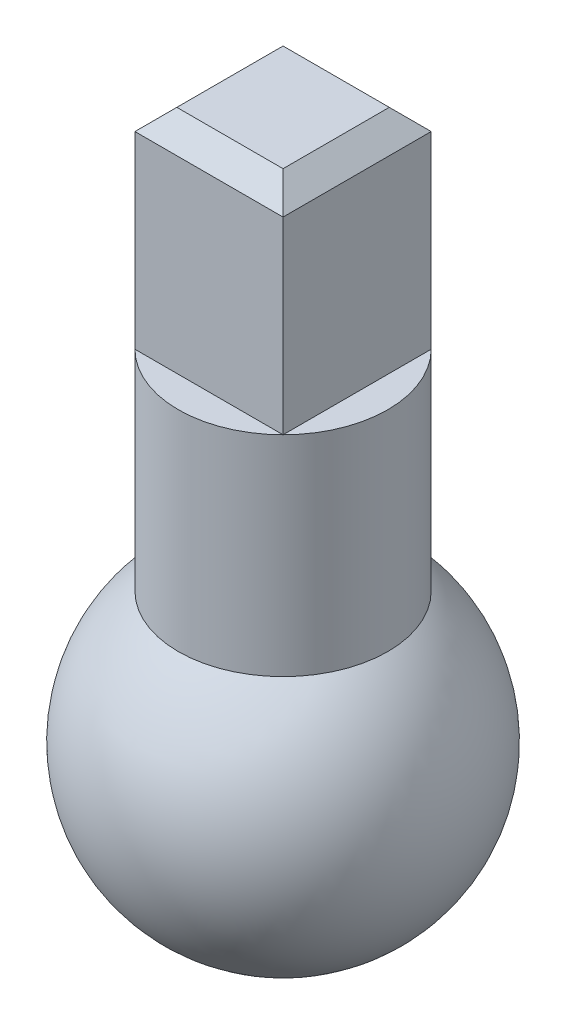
ISO-10303-21;
HEADER;
FILE_DESCRIPTION(('STEP AP214'),'2;1');
FILE_NAME('part.step','',(''),(''),'','','');
FILE_SCHEMA(('AUTOMOTIVE_DESIGN { 1 0 10303 214 1 1 1 1 }'));
ENDSEC;
DATA;
#1=APPLICATION_CONTEXT('core data for automotive mechanical design processes');
#2=APPLICATION_PROTOCOL_DEFINITION('international standard','automotive_design',2000,#1);
#3=PRODUCT_CONTEXT('',#1,'mechanical');
#4=PRODUCT('Part','Part','',(#3));
#5=PRODUCT_RELATED_PRODUCT_CATEGORY('part','',(#4));
#6=PRODUCT_DEFINITION_FORMATION('','',#4);
#7=PRODUCT_DEFINITION_CONTEXT('part definition',#1,'design');
#8=PRODUCT_DEFINITION('design','',#6,#7);
#9=PRODUCT_DEFINITION_SHAPE('','',#8);
#10=(LENGTH_UNIT() NAMED_UNIT(*) SI_UNIT(.MILLI.,.METRE.));
#11=(NAMED_UNIT(*) PLANE_ANGLE_UNIT() SI_UNIT($,.RADIAN.));
#12=(NAMED_UNIT(*) SI_UNIT($,.STERADIAN.) SOLID_ANGLE_UNIT());
#13=UNCERTAINTY_MEASURE_WITH_UNIT(LENGTH_MEASURE(1.E-05),#10,'distance_accuracy_value','');
#14=(GEOMETRIC_REPRESENTATION_CONTEXT(3) GLOBAL_UNCERTAINTY_ASSIGNED_CONTEXT((#13)) GLOBAL_UNIT_ASSIGNED_CONTEXT((#10,
#11,#12)) REPRESENTATION_CONTEXT('',''));
#15=CARTESIAN_POINT('',(0.,0.,0.));
#16=DIRECTION('',(0.,0.,1.));
#17=DIRECTION('',(1.,0.,0.));
#18=AXIS2_PLACEMENT_3D('',#15,#16,#17);
#19=CARTESIAN_POINT('',(0.,5.,0.));
#20=DIRECTION('',(0.,1.,0.));
#21=DIRECTION('',(0.,0.,1.));
#22=AXIS2_PLACEMENT_3D('',#19,#20,#21);
#23=PLANE('',#22);
#24=DIRECTION('',(0.,0.,-1.));
#25=VECTOR('',#24,1.);
#26=CARTESIAN_POINT('',(1.76776695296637,5.,-1.76776695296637));
#27=LINE('',#26,#25);
#28=CARTESIAN_POINT('',(1.76776695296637,5.,1.76776695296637));
#29=VERTEX_POINT('',#28);
#30=CARTESIAN_POINT('',(1.76776695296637,5.,-1.76776695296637));
#31=VERTEX_POINT('',#30);
#32=EDGE_CURVE('E117',#29,#31,#27,.T.);
#33=ORIENTED_EDGE('',*,*,#32,.F.);
#34=CARTESIAN_POINT('',(0.,5.,0.));
#35=DIRECTION('',(0.,1.,0.));
#36=DIRECTION('',(0.,0.,1.));
#37=AXIS2_PLACEMENT_3D('',#34,#35,#36);
#38=CIRCLE('',#37,2.5);
#39=EDGE_CURVE('E103',#29,#31,#38,.T.);
#40=ORIENTED_EDGE('',*,*,#39,.T.);
#41=EDGE_LOOP('',(#33,#40));
#42=FACE_BOUND('',#41,.T.);
#43=ADVANCED_FACE('F32',(#42),#23,.T.);
#44=DIRECTION('',(1.,0.,0.));
#45=VECTOR('',#44,1.);
#46=CARTESIAN_POINT('',(-1.76776695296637,5.,1.76776695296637));
#47=LINE('',#46,#45);
#48=CARTESIAN_POINT('',(-1.76776695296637,5.,1.76776695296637));
#49=VERTEX_POINT('',#48);
#50=EDGE_CURVE('E114',#49,#29,#47,.T.);
#51=ORIENTED_EDGE('',*,*,#50,.F.);
#52=EDGE_CURVE('E111',#49,#29,#38,.T.);
#53=ORIENTED_EDGE('',*,*,#52,.T.);
#54=EDGE_LOOP('',(#51,#53));
#55=FACE_BOUND('',#54,.T.);
#56=ADVANCED_FACE('F185',(#55),#23,.T.);
#57=DIRECTION('',(0.,0.,1.));
#58=VECTOR('',#57,1.);
#59=CARTESIAN_POINT('',(-1.76776695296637,5.,-1.76776695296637));
#60=LINE('',#59,#58);
#61=CARTESIAN_POINT('',(-1.76776695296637,5.,-1.76776695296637));
#62=VERTEX_POINT('',#61);
#63=EDGE_CURVE('E88',#62,#49,#60,.T.);
#64=ORIENTED_EDGE('',*,*,#63,.F.);
#65=EDGE_CURVE('E104',#62,#49,#38,.T.);
#66=ORIENTED_EDGE('',*,*,#65,.T.);
#67=EDGE_LOOP('',(#64,#66));
#68=FACE_BOUND('',#67,.T.);
#69=ADVANCED_FACE('F113',(#68),#23,.T.);
#70=CARTESIAN_POINT('',(0.,5.,0.));
#71=DIRECTION('',(0.,-1.,0.));
#72=DIRECTION('',(0.,0.,-1.));
#73=AXIS2_PLACEMENT_3D('',#70,#71,#72);
#74=CYLINDRICAL_SURFACE('',#73,2.5);
#75=ORIENTED_EDGE('',*,*,#39,.F.);
#76=ORIENTED_EDGE('',*,*,#52,.F.);
#77=ORIENTED_EDGE('',*,*,#65,.F.);
#78=EDGE_CURVE('E96',#31,#62,#38,.T.);
#79=ORIENTED_EDGE('',*,*,#78,.F.);
#80=EDGE_LOOP('',(#75,#76,#77,#79));
#81=FACE_BOUND('',#80,.T.);
#82=CARTESIAN_POINT('',(0.,0.,0.));
#83=DIRECTION('',(0.,1.,0.));
#84=DIRECTION('',(0.,0.,1.));
#85=AXIS2_PLACEMENT_3D('',#82,#83,#84);
#86=CIRCLE('',#85,2.5);
#87=CARTESIAN_POINT('',(0.,0.,2.5));
#88=VERTEX_POINT('',#87);
#89=EDGE_CURVE('E36',#88,#88,#86,.T.);
#90=ORIENTED_EDGE('',*,*,#89,.T.);
#91=EDGE_LOOP('',(#90));
#92=FACE_BOUND('',#91,.T.);
#93=ADVANCED_FACE('F108',(#81,#92),#74,.T.);
#94=DIRECTION('',(-1.,0.,0.));
#95=VECTOR('',#94,1.);
#96=CARTESIAN_POINT('',(-1.76776695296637,5.,-1.76776695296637));
#97=LINE('',#96,#95);
#98=EDGE_CURVE('E99',#31,#62,#97,.T.);
#99=ORIENTED_EDGE('',*,*,#98,.F.);
#100=ORIENTED_EDGE('',*,*,#78,.T.);
#101=EDGE_LOOP('',(#99,#100));
#102=FACE_BOUND('',#101,.T.);
#103=ADVANCED_FACE('F98',(#102),#23,.T.);
#104=CARTESIAN_POINT('',(0.,-3.10985915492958,0.));
#105=DIRECTION('',(0.,0.,1.));
#106=DIRECTION('',(1.,0.,0.));
#107=AXIS2_PLACEMENT_3D('',#104,#105,#106);
#108=SPHERICAL_SURFACE('',#107,3.99014084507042);
#109=CARTESIAN_POINT('',(0.,-3.10985915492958,0.));
#110=DIRECTION('',(0.,1.,0.));
#111=DIRECTION('',(0.,0.,1.));
#112=AXIS2_PLACEMENT_3D('',#109,#110,#111);
#113=SPHERICAL_SURFACE('',#112,3.99014084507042);
#114=ORIENTED_EDGE('',*,*,#89,.F.);
#115=EDGE_LOOP('',(#114));
#116=FACE_BOUND('',#115,.T.);
#117=ADVANCED_FACE('F34',(#116),#113,.T.);
#118=CARTESIAN_POINT('',(1.76776695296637,10.,-1.76776695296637));
#119=DIRECTION('',(-1.,0.,0.));
#120=DIRECTION('',(0.,0.,1.));
#121=AXIS2_PLACEMENT_3D('',#118,#119,#120);
#122=PLANE('',#121);
#123=DIRECTION('',(0.,-1.,0.));
#124=VECTOR('',#123,1.);
#125=CARTESIAN_POINT('',(1.76776695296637,10.,-1.76776695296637));
#126=LINE('',#125,#124);
#127=CARTESIAN_POINT('',(1.76776695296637,9.5,-1.76776695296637));
#128=VERTEX_POINT('',#127);
#129=EDGE_CURVE('E90',#128,#31,#126,.T.);
#130=ORIENTED_EDGE('',*,*,#129,.F.);
#131=DIRECTION('',(0.,0.,1.));
#132=VECTOR('',#131,1.);
#133=CARTESIAN_POINT('',(1.76776695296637,9.5,1.76776695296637));
#134=LINE('',#133,#132);
#135=CARTESIAN_POINT('',(1.76776695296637,9.5,1.76776695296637));
#136=VERTEX_POINT('',#135);
#137=EDGE_CURVE('E11',#128,#136,#134,.T.);
#138=ORIENTED_EDGE('',*,*,#137,.T.);
#139=DIRECTION('',(0.,-1.,0.));
#140=VECTOR('',#139,1.);
#141=CARTESIAN_POINT('',(1.76776695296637,10.,1.76776695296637));
#142=LINE('',#141,#140);
#143=EDGE_CURVE('E125',#136,#29,#142,.T.);
#144=ORIENTED_EDGE('',*,*,#143,.T.);
#145=ORIENTED_EDGE('',*,*,#32,.T.);
#146=EDGE_LOOP('',(#130,#138,#144,#145));
#147=FACE_BOUND('',#146,.T.);
#148=ADVANCED_FACE('F166',(#147),#122,.F.);
#149=CARTESIAN_POINT('',(-1.76776695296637,10.,-1.76776695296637));
#150=DIRECTION('',(0.,0.,1.));
#151=DIRECTION('',(1.,0.,0.));
#152=AXIS2_PLACEMENT_3D('',#149,#150,#151);
#153=PLANE('',#152);
#154=DIRECTION('',(0.,-1.,0.));
#155=VECTOR('',#154,1.);
#156=CARTESIAN_POINT('',(-1.76776695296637,10.,-1.76776695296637));
#157=LINE('',#156,#155);
#158=CARTESIAN_POINT('',(-1.76776695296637,9.5,-1.76776695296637));
#159=VERTEX_POINT('',#158);
#160=EDGE_CURVE('E84',#159,#62,#157,.T.);
#161=ORIENTED_EDGE('',*,*,#160,.F.);
#162=DIRECTION('',(1.,0.,0.));
#163=VECTOR('',#162,1.);
#164=CARTESIAN_POINT('',(1.76776695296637,9.5,-1.76776695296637));
#165=LINE('',#164,#163);
#166=EDGE_CURVE('E41',#159,#128,#165,.T.);
#167=ORIENTED_EDGE('',*,*,#166,.T.);
#168=ORIENTED_EDGE('',*,*,#129,.T.);
#169=ORIENTED_EDGE('',*,*,#98,.T.);
#170=EDGE_LOOP('',(#161,#167,#168,#169));
#171=FACE_BOUND('',#170,.T.);
#172=ADVANCED_FACE('F116',(#171),#153,.F.);
#173=CARTESIAN_POINT('',(-1.76776695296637,10.,-1.76776695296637));
#174=DIRECTION('',(1.,0.,0.));
#175=DIRECTION('',(0.,0.,-1.));
#176=AXIS2_PLACEMENT_3D('',#173,#174,#175);
#177=PLANE('',#176);
#178=DIRECTION('',(0.,-1.,0.));
#179=VECTOR('',#178,1.);
#180=CARTESIAN_POINT('',(-1.76776695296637,10.,1.76776695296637));
#181=LINE('',#180,#179);
#182=CARTESIAN_POINT('',(-1.76776695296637,9.5,1.76776695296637));
#183=VERTEX_POINT('',#182);
#184=EDGE_CURVE('E91',#183,#49,#181,.T.);
#185=ORIENTED_EDGE('',*,*,#184,.F.);
#186=DIRECTION('',(0.,0.,-1.));
#187=VECTOR('',#186,1.);
#188=CARTESIAN_POINT('',(-1.76776695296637,9.5,-1.76776695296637));
#189=LINE('',#188,#187);
#190=EDGE_CURVE('E56',#183,#159,#189,.T.);
#191=ORIENTED_EDGE('',*,*,#190,.T.);
#192=ORIENTED_EDGE('',*,*,#160,.T.);
#193=ORIENTED_EDGE('',*,*,#63,.T.);
#194=EDGE_LOOP('',(#185,#191,#192,#193));
#195=FACE_BOUND('',#194,.T.);
#196=ADVANCED_FACE('F86',(#195),#177,.F.);
#197=CARTESIAN_POINT('',(-1.76776695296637,10.,1.76776695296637));
#198=DIRECTION('',(0.,0.,-1.));
#199=DIRECTION('',(-1.,0.,0.));
#200=AXIS2_PLACEMENT_3D('',#197,#198,#199);
#201=PLANE('',#200);
#202=ORIENTED_EDGE('',*,*,#143,.F.);
#203=DIRECTION('',(-1.,0.,0.));
#204=VECTOR('',#203,1.);
#205=CARTESIAN_POINT('',(-1.76776695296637,9.5,1.76776695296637));
#206=LINE('',#205,#204);
#207=EDGE_CURVE('E138',#136,#183,#206,.T.);
#208=ORIENTED_EDGE('',*,*,#207,.T.);
#209=ORIENTED_EDGE('',*,*,#184,.T.);
#210=ORIENTED_EDGE('',*,*,#50,.T.);
#211=EDGE_LOOP('',(#202,#208,#209,#210));
#212=FACE_BOUND('',#211,.T.);
#213=ADVANCED_FACE('F170',(#212),#201,.F.);
#214=CARTESIAN_POINT('',(0.,10.,0.));
#215=DIRECTION('',(0.,1.,0.));
#216=DIRECTION('',(0.,0.,1.));
#217=AXIS2_PLACEMENT_3D('',#214,#215,#216);
#218=PLANE('',#217);
#219=DIRECTION('',(0.,0.,1.));
#220=VECTOR('',#219,1.);
#221=CARTESIAN_POINT('',(-1.26776695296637,10.,1.76776695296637));
#222=LINE('',#221,#220);
#223=CARTESIAN_POINT('',(-1.26776695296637,10.,-1.26776695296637));
#224=VERTEX_POINT('',#223);
#225=CARTESIAN_POINT('',(-1.26776695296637,10.,1.26776695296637));
#226=VERTEX_POINT('',#225);
#227=EDGE_CURVE('E133',#224,#226,#222,.T.);
#228=ORIENTED_EDGE('',*,*,#227,.T.);
#229=DIRECTION('',(1.,0.,0.));
#230=VECTOR('',#229,1.);
#231=CARTESIAN_POINT('',(1.76776695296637,10.,1.26776695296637));
#232=LINE('',#231,#230);
#233=CARTESIAN_POINT('',(1.26776695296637,10.,1.26776695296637));
#234=VERTEX_POINT('',#233);
#235=EDGE_CURVE('E135',#226,#234,#232,.T.);
#236=ORIENTED_EDGE('',*,*,#235,.T.);
#237=DIRECTION('',(0.,0.,-1.));
#238=VECTOR('',#237,1.);
#239=CARTESIAN_POINT('',(1.26776695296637,10.,-1.76776695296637));
#240=LINE('',#239,#238);
#241=CARTESIAN_POINT('',(1.26776695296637,10.,-1.26776695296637));
#242=VERTEX_POINT('',#241);
#243=EDGE_CURVE('E129',#234,#242,#240,.T.);
#244=ORIENTED_EDGE('',*,*,#243,.T.);
#245=DIRECTION('',(-1.,0.,0.));
#246=VECTOR('',#245,1.);
#247=CARTESIAN_POINT('',(-1.76776695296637,10.,-1.26776695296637));
#248=LINE('',#247,#246);
#249=EDGE_CURVE('E131',#242,#224,#248,.T.);
#250=ORIENTED_EDGE('',*,*,#249,.T.);
#251=EDGE_LOOP('',(#228,#236,#244,#250));
#252=FACE_BOUND('',#251,.T.);
#253=ADVANCED_FACE('F176',(#252),#218,.T.);
#254=CARTESIAN_POINT('',(0.,10.,-1.26776695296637));
#255=DIRECTION('',(0.,0.707106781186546,-0.707106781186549));
#256=DIRECTION('',(1.,0.,0.));
#257=AXIS2_PLACEMENT_3D('',#254,#255,#256);
#258=PLANE('',#257);
#259=DIRECTION('',(-0.577350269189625,0.577350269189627,0.577350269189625));
#260=VECTOR('',#259,1.);
#261=CARTESIAN_POINT('',(0.845177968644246,10.4225889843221,-0.845177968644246));
#262=LINE('',#261,#260);
#263=EDGE_CURVE('E147',#128,#242,#262,.T.);
#264=ORIENTED_EDGE('',*,*,#263,.F.);
#265=ORIENTED_EDGE('',*,*,#166,.F.);
#266=DIRECTION('',(0.577350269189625,0.577350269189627,0.577350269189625));
#267=VECTOR('',#266,1.);
#268=CARTESIAN_POINT('',(-0.845177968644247,10.4225889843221,-0.845177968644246));
#269=LINE('',#268,#267);
#270=EDGE_CURVE('E120',#224,#159,#269,.F.);
#271=ORIENTED_EDGE('',*,*,#270,.F.);
#272=ORIENTED_EDGE('',*,*,#249,.F.);
#273=EDGE_LOOP('',(#264,#265,#271,#272));
#274=FACE_BOUND('',#273,.T.);
#275=ADVANCED_FACE('F158',(#274),#258,.T.);
#276=CARTESIAN_POINT('',(-1.26776695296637,10.,0.));
#277=DIRECTION('',(-0.707106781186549,0.707106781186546,0.));
#278=DIRECTION('',(0.,0.,-1.));
#279=AXIS2_PLACEMENT_3D('',#276,#277,#278);
#280=PLANE('',#279);
#281=ORIENTED_EDGE('',*,*,#270,.T.);
#282=ORIENTED_EDGE('',*,*,#190,.F.);
#283=DIRECTION('',(0.577350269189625,0.577350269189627,-0.577350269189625));
#284=VECTOR('',#283,1.);
#285=CARTESIAN_POINT('',(-0.845177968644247,10.4225889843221,0.845177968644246));
#286=LINE('',#285,#284);
#287=EDGE_CURVE('E145',#226,#183,#286,.F.);
#288=ORIENTED_EDGE('',*,*,#287,.F.);
#289=ORIENTED_EDGE('',*,*,#227,.F.);
#290=EDGE_LOOP('',(#281,#282,#288,#289));
#291=FACE_BOUND('',#290,.T.);
#292=ADVANCED_FACE('F153',(#291),#280,.T.);
#293=CARTESIAN_POINT('',(1.26776695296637,10.,0.));
#294=DIRECTION('',(0.707106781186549,0.707106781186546,0.));
#295=DIRECTION('',(0.,0.,1.));
#296=AXIS2_PLACEMENT_3D('',#293,#294,#295);
#297=PLANE('',#296);
#298=ORIENTED_EDGE('',*,*,#263,.T.);
#299=ORIENTED_EDGE('',*,*,#243,.F.);
#300=DIRECTION('',(0.577350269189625,-0.577350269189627,0.577350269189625));
#301=VECTOR('',#300,1.);
#302=CARTESIAN_POINT('',(0.845177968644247,10.4225889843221,0.845177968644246));
#303=LINE('',#302,#301);
#304=EDGE_CURVE('E143',#136,#234,#303,.F.);
#305=ORIENTED_EDGE('',*,*,#304,.F.);
#306=ORIENTED_EDGE('',*,*,#137,.F.);
#307=EDGE_LOOP('',(#298,#299,#305,#306));
#308=FACE_BOUND('',#307,.T.);
#309=ADVANCED_FACE('F163',(#308),#297,.T.);
#310=CARTESIAN_POINT('',(0.,10.,1.26776695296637));
#311=DIRECTION('',(0.,0.707106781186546,0.707106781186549));
#312=DIRECTION('',(-1.,0.,0.));
#313=AXIS2_PLACEMENT_3D('',#310,#311,#312);
#314=PLANE('',#313);
#315=ORIENTED_EDGE('',*,*,#287,.T.);
#316=ORIENTED_EDGE('',*,*,#207,.F.);
#317=ORIENTED_EDGE('',*,*,#304,.T.);
#318=ORIENTED_EDGE('',*,*,#235,.F.);
#319=EDGE_LOOP('',(#315,#316,#317,#318));
#320=FACE_BOUND('',#319,.T.);
#321=ADVANCED_FACE('F173',(#320),#314,.T.);
#322=CLOSED_SHELL('',(#43,#56,#69,#93,#103,#117,#148,#172,#196,#213,#253,#275,#292,#309,#321));
#323=MANIFOLD_SOLID_BREP('B2',#322);
#324=ADVANCED_BREP_SHAPE_REPRESENTATION('',(#18,#323),#14);
#325=SHAPE_DEFINITION_REPRESENTATION(#9,#324);
ENDSEC;
END-ISO-10303-21;
